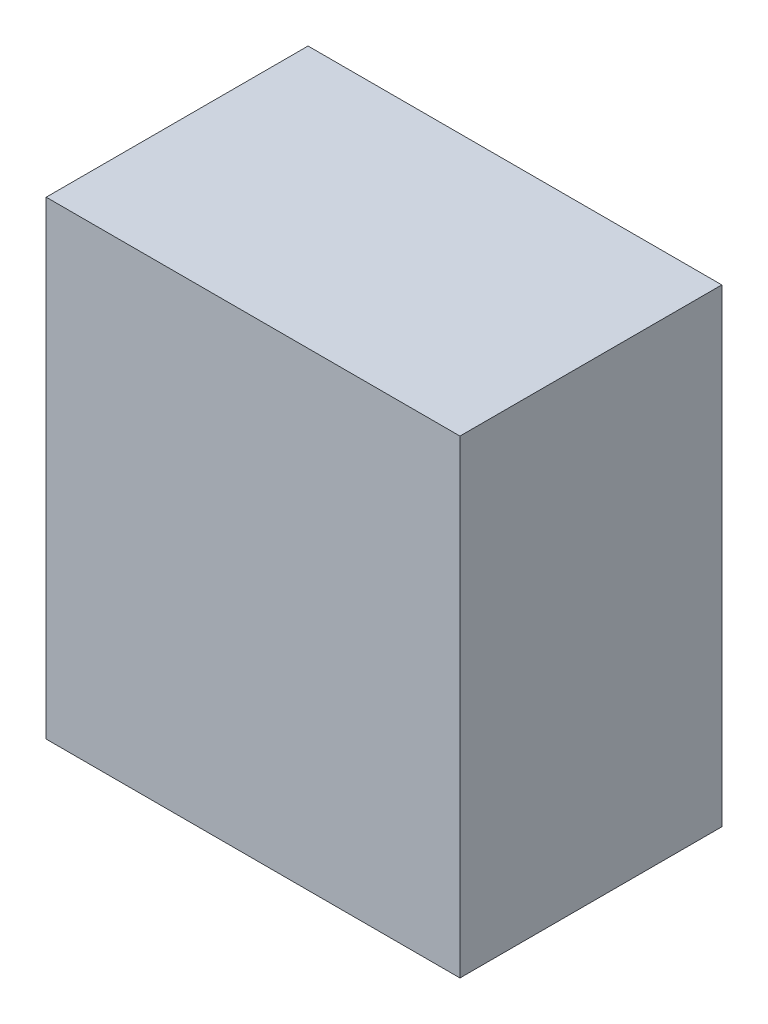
ISO-10303-21;
HEADER;
FILE_DESCRIPTION(('STEP AP214'),'2;1');
FILE_NAME('part.step','',(''),(''),'','','');
FILE_SCHEMA(('AUTOMOTIVE_DESIGN { 1 0 10303 214 1 1 1 1 }'));
ENDSEC;
DATA;
#1=APPLICATION_CONTEXT('core data for automotive mechanical design processes');
#2=APPLICATION_PROTOCOL_DEFINITION('international standard','automotive_design',2000,#1);
#3=PRODUCT_CONTEXT('',#1,'mechanical');
#4=PRODUCT('Part','Part','',(#3));
#5=PRODUCT_RELATED_PRODUCT_CATEGORY('part','',(#4));
#6=PRODUCT_DEFINITION_FORMATION('','',#4);
#7=PRODUCT_DEFINITION_CONTEXT('part definition',#1,'design');
#8=PRODUCT_DEFINITION('design','',#6,#7);
#9=PRODUCT_DEFINITION_SHAPE('','',#8);
#10=(LENGTH_UNIT() NAMED_UNIT(*) SI_UNIT(.MILLI.,.METRE.));
#11=(NAMED_UNIT(*) PLANE_ANGLE_UNIT() SI_UNIT($,.RADIAN.));
#12=(NAMED_UNIT(*) SI_UNIT($,.STERADIAN.) SOLID_ANGLE_UNIT());
#13=UNCERTAINTY_MEASURE_WITH_UNIT(LENGTH_MEASURE(1.E-05),#10,'distance_accuracy_value','');
#14=(GEOMETRIC_REPRESENTATION_CONTEXT(3) GLOBAL_UNCERTAINTY_ASSIGNED_CONTEXT((#13)) GLOBAL_UNIT_ASSIGNED_CONTEXT((#10,
#11,#12)) REPRESENTATION_CONTEXT('',''));
#15=CARTESIAN_POINT('',(0.,0.,0.));
#16=DIRECTION('',(0.,0.,1.));
#17=DIRECTION('',(1.,0.,0.));
#18=AXIS2_PLACEMENT_3D('',#15,#16,#17);
#19=CARTESIAN_POINT('',(-8.375,0.,5.3));
#20=DIRECTION('',(1.,0.,0.));
#21=DIRECTION('',(0.,0.,-1.));
#22=AXIS2_PLACEMENT_3D('',#19,#20,#21);
#23=PLANE('',#22);
#24=DIRECTION('',(0.,-1.,0.));
#25=VECTOR('',#24,1.);
#26=CARTESIAN_POINT('',(-8.375,0.,-5.3));
#27=LINE('',#26,#25);
#28=CARTESIAN_POINT('',(-8.375,19.,-5.3));
#29=VERTEX_POINT('',#28);
#30=CARTESIAN_POINT('',(-8.375,0.,-5.3));
#31=VERTEX_POINT('',#30);
#32=EDGE_CURVE('E11',#29,#31,#27,.T.);
#33=ORIENTED_EDGE('',*,*,#32,.T.);
#34=DIRECTION('',(0.,0.,-1.));
#35=VECTOR('',#34,1.);
#36=CARTESIAN_POINT('',(-8.375,0.,5.3));
#37=LINE('',#36,#35);
#38=CARTESIAN_POINT('',(-8.375,0.,5.3));
#39=VERTEX_POINT('',#38);
#40=EDGE_CURVE('E36',#39,#31,#37,.T.);
#41=ORIENTED_EDGE('',*,*,#40,.F.);
#42=DIRECTION('',(0.,-1.,0.));
#43=VECTOR('',#42,1.);
#44=CARTESIAN_POINT('',(-8.375,0.,5.3));
#45=LINE('',#44,#43);
#46=CARTESIAN_POINT('',(-8.375,19.,5.3));
#47=VERTEX_POINT('',#46);
#48=EDGE_CURVE('E73',#47,#39,#45,.T.);
#49=ORIENTED_EDGE('',*,*,#48,.F.);
#50=DIRECTION('',(0.,0.,-1.));
#51=VECTOR('',#50,1.);
#52=CARTESIAN_POINT('',(-8.375,19.,5.3));
#53=LINE('',#52,#51);
#54=EDGE_CURVE('E27',#47,#29,#53,.T.);
#55=ORIENTED_EDGE('',*,*,#54,.T.);
#56=EDGE_LOOP('',(#33,#41,#49,#55));
#57=FACE_BOUND('',#56,.T.);
#58=ADVANCED_FACE('F17',(#57),#23,.F.);
#59=CARTESIAN_POINT('',(-8.375,0.,5.3));
#60=DIRECTION('',(0.,1.,0.));
#61=DIRECTION('',(-1.,0.,0.));
#62=AXIS2_PLACEMENT_3D('',#59,#60,#61);
#63=PLANE('',#62);
#64=DIRECTION('',(1.,0.,0.));
#65=VECTOR('',#64,1.);
#66=CARTESIAN_POINT('',(-8.375,0.,-5.3));
#67=LINE('',#66,#65);
#68=CARTESIAN_POINT('',(8.375,0.,-5.3));
#69=VERTEX_POINT('',#68);
#70=EDGE_CURVE('E80',#31,#69,#67,.T.);
#71=ORIENTED_EDGE('',*,*,#70,.T.);
#72=DIRECTION('',(0.,0.,-1.));
#73=VECTOR('',#72,1.);
#74=CARTESIAN_POINT('',(8.375,0.,5.3));
#75=LINE('',#74,#73);
#76=CARTESIAN_POINT('',(8.375,0.,5.3));
#77=VERTEX_POINT('',#76);
#78=EDGE_CURVE('E86',#77,#69,#75,.T.);
#79=ORIENTED_EDGE('',*,*,#78,.F.);
#80=DIRECTION('',(1.,0.,0.));
#81=VECTOR('',#80,1.);
#82=CARTESIAN_POINT('',(-8.375,0.,5.3));
#83=LINE('',#82,#81);
#84=EDGE_CURVE('E64',#39,#77,#83,.T.);
#85=ORIENTED_EDGE('',*,*,#84,.F.);
#86=ORIENTED_EDGE('',*,*,#40,.T.);
#87=EDGE_LOOP('',(#71,#79,#85,#86));
#88=FACE_BOUND('',#87,.T.);
#89=ADVANCED_FACE('F90',(#88),#63,.F.);
#90=CARTESIAN_POINT('',(8.375,0.,5.3));
#91=DIRECTION('',(-1.,0.,0.));
#92=DIRECTION('',(0.,0.,1.));
#93=AXIS2_PLACEMENT_3D('',#90,#91,#92);
#94=PLANE('',#93);
#95=DIRECTION('',(0.,1.,0.));
#96=VECTOR('',#95,1.);
#97=CARTESIAN_POINT('',(8.375,0.,-5.3));
#98=LINE('',#97,#96);
#99=CARTESIAN_POINT('',(8.375,19.,-5.3));
#100=VERTEX_POINT('',#99);
#101=EDGE_CURVE('E70',#69,#100,#98,.T.);
#102=ORIENTED_EDGE('',*,*,#101,.T.);
#103=DIRECTION('',(0.,0.,-1.));
#104=VECTOR('',#103,1.);
#105=CARTESIAN_POINT('',(8.375,19.,5.3));
#106=LINE('',#105,#104);
#107=CARTESIAN_POINT('',(8.375,19.,5.3));
#108=VERTEX_POINT('',#107);
#109=EDGE_CURVE('E56',#108,#100,#106,.T.);
#110=ORIENTED_EDGE('',*,*,#109,.F.);
#111=DIRECTION('',(0.,1.,0.));
#112=VECTOR('',#111,1.);
#113=CARTESIAN_POINT('',(8.375,0.,5.3));
#114=LINE('',#113,#112);
#115=EDGE_CURVE('E62',#77,#108,#114,.T.);
#116=ORIENTED_EDGE('',*,*,#115,.F.);
#117=ORIENTED_EDGE('',*,*,#78,.T.);
#118=EDGE_LOOP('',(#102,#110,#116,#117));
#119=FACE_BOUND('',#118,.T.);
#120=ADVANCED_FACE('F68',(#119),#94,.F.);
#121=CARTESIAN_POINT('',(-8.375,19.,5.3));
#122=DIRECTION('',(0.,-1.,0.));
#123=DIRECTION('',(1.,0.,0.));
#124=AXIS2_PLACEMENT_3D('',#121,#122,#123);
#125=PLANE('',#124);
#126=DIRECTION('',(-1.,0.,0.));
#127=VECTOR('',#126,1.);
#128=CARTESIAN_POINT('',(-8.375,19.,-5.3));
#129=LINE('',#128,#127);
#130=EDGE_CURVE('E72',#100,#29,#129,.T.);
#131=ORIENTED_EDGE('',*,*,#130,.T.);
#132=ORIENTED_EDGE('',*,*,#54,.F.);
#133=DIRECTION('',(-1.,0.,0.));
#134=VECTOR('',#133,1.);
#135=CARTESIAN_POINT('',(-8.375,19.,5.3));
#136=LINE('',#135,#134);
#137=EDGE_CURVE('E21',#108,#47,#136,.T.);
#138=ORIENTED_EDGE('',*,*,#137,.F.);
#139=ORIENTED_EDGE('',*,*,#109,.T.);
#140=EDGE_LOOP('',(#131,#132,#138,#139));
#141=FACE_BOUND('',#140,.T.);
#142=ADVANCED_FACE('F76',(#141),#125,.F.);
#143=CARTESIAN_POINT('',(-8.375,0.,5.3));
#144=DIRECTION('',(0.,0.,-1.));
#145=DIRECTION('',(-1.,0.,0.));
#146=AXIS2_PLACEMENT_3D('',#143,#144,#145);
#147=PLANE('',#146);
#148=ORIENTED_EDGE('',*,*,#48,.T.);
#149=ORIENTED_EDGE('',*,*,#84,.T.);
#150=ORIENTED_EDGE('',*,*,#115,.T.);
#151=ORIENTED_EDGE('',*,*,#137,.T.);
#152=EDGE_LOOP('',(#148,#149,#150,#151));
#153=FACE_BOUND('',#152,.T.);
#154=ADVANCED_FACE('F63',(#153),#147,.F.);
#155=CARTESIAN_POINT('',(-8.375,0.,-5.3));
#156=DIRECTION('',(0.,0.,-1.));
#157=DIRECTION('',(-1.,0.,0.));
#158=AXIS2_PLACEMENT_3D('',#155,#156,#157);
#159=PLANE('',#158);
#160=ORIENTED_EDGE('',*,*,#32,.F.);
#161=ORIENTED_EDGE('',*,*,#130,.F.);
#162=ORIENTED_EDGE('',*,*,#101,.F.);
#163=ORIENTED_EDGE('',*,*,#70,.F.);
#164=EDGE_LOOP('',(#160,#161,#162,#163));
#165=FACE_BOUND('',#164,.T.);
#166=ADVANCED_FACE('F19',(#165),#159,.T.);
#167=CLOSED_SHELL('',(#58,#89,#120,#142,#154,#166));
#168=MANIFOLD_SOLID_BREP('B1',#167);
#169=ADVANCED_BREP_SHAPE_REPRESENTATION('',(#18,#168),#14);
#170=SHAPE_DEFINITION_REPRESENTATION(#9,#169);
ENDSEC;
END-ISO-10303-21;
